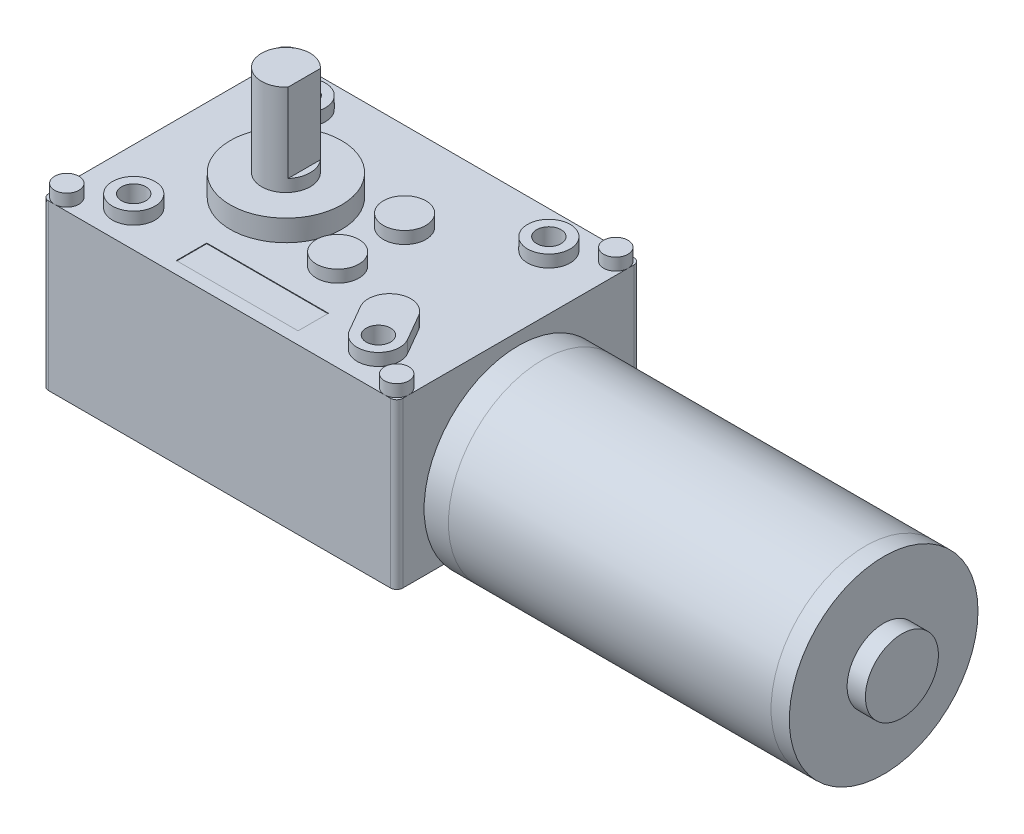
from build123d import *

# Parameters (mm, degrees)
SKETCH1_W            = 58.2
SKETCH1_H            = 40
BOSS_EXTRUDE1_DEPTH  = 13.5
SKETCH2_R            = 2
BOSS_EXTRUDE2_DEPTH  = 2
SKETCH3_R            = 3.5
BOSS_EXTRUDE3_DEPTH  = 15.5
SKETCH4_R            = 9.15
BOSS_EXTRUDE4_DEPTH  = 17
SKETCH5_R            = 4
BOSS_EXTRUDE5_DEPTH  = 2
BOSS_EXTRUDE6_DEPTH  = 13
SKETCH7_R            = 15.5
BOSS_EXTRUDE7_DEPTH  = 4
SKETCH8_R            = 15.5
BOSS_EXTRUDE8_DEPTH  = 53
SKETCH9_R            = 15.5
BOSS_EXTRUDE9_DEPTH  = 3
SKETCH11_R           = 6
BOSS_EXTRUDE10_DEPTH = 3
FILLET1_R            = 1
SKETCH12_R           = 2
CUT_EXTRUDE1_DEPTH   = 3
CUT_EXTRUDE2_START   = -3
SKETCH13_R           = 2
CUT_EXTRUDE2_DEPTH   = 3
SKETCH14_W           = 20
SKETCH14_H           = 5
CUT_EXTRUDE3_DEPTH   = 0.1
SKETCH15_W           = 20
SKETCH15_H           = 5
CUT_EXTRUDE4_DEPTH   = 0.1


with BuildPart() as part:
    # Sketch1 → Boss-Extrude1 (new, symmetric)
    with BuildSketch(Plane(origin=(0, 0, 0), x_dir=(1, 0, 0), z_dir=(0, 1, 0))):
        with Locations((29.1, 20)):
            Rectangle(SKETCH1_W, SKETCH1_H)
    extrude(amount=BOSS_EXTRUDE1_DEPTH, both=True)

    # Sketch2 → Boss-Extrude2 (add)
    with BuildSketch(Plane(origin=(0, 13.5, 0), x_dir=(1, 0, 0), z_dir=(0, 1, 0))):
        with Locations(Location((2, 38, 0), (0, 0, 90))):
            Circle(SKETCH2_R)
        with Locations(Location((56.2, 38, 0), (0, 0, 90))):
            Circle(SKETCH2_R)
        with Locations(Location((56.2, 2, 0), (0, 0, 270))):
            Circle(SKETCH2_R)
        with Locations(Location((2, 2, 0), (0, 0, 270))):
            Circle(SKETCH2_R)
    extrude(amount=BOSS_EXTRUDE2_DEPTH)

    # Sketch3 → Boss-Extrude3 (add, symmetric)
    with BuildSketch(Plane(origin=(0, 0, 0), x_dir=(1, 0, 0), z_dir=(0, 1, 0))):
        with Locations(Location((9, 34, 0), (0, 0, 90))):
            Circle(SKETCH3_R)
        with Locations(Location((49.2, 34, 0), (0, 0, 90))):
            Circle(SKETCH3_R)
        with Locations(Location((9, 6, 0), (0, 0, 90))):
            Circle(SKETCH3_R)
        with Locations(Location((34, 14.5, 0), (0, 0, 90))):
            Circle(SKETCH3_R)
        with Locations(Location((34, 25.5, 0), (0, 0, 90))):
            Circle(SKETCH3_R)
        with BuildLine():
            Line((49.731088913, 12.080127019), (52.231088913, 7.75))
            ThreePointArc((52.231088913, 7.75), (50.95, 2.968911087), (46.168911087, 4.25))
            Line((46.168911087, 4.25), (43.668911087, 8.580127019))
            ThreePointArc((43.668911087, 8.580127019), (44.95, 13.361215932), (49.731088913, 12.080127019))
        make_face()
    extrude(amount=BOSS_EXTRUDE3_DEPTH, both=True)

    # Sketch4 → Boss-Extrude4 (add, symmetric)
    with BuildSketch(Plane(origin=(0, 0, 0), x_dir=(1, 0, 0), z_dir=(0, 1, 0))):
        with Locations(Location((20, 20, 0), (0, 0, 90))):
            Circle(SKETCH4_R)
    extrude(amount=BOSS_EXTRUDE4_DEPTH, both=True)

    # Sketch5 → Boss-Extrude5 (add)
    with BuildSketch(Plane(origin=(0, 17, 0), x_dir=(1, 0, 0), z_dir=(0, 1, 0))):
        with Locations(Location((20, 20, 0), (0, 0, 270))):
            Circle(SKETCH5_R)
    extrude(amount=BOSS_EXTRUDE5_DEPTH)

    # Sketch6 → Boss-Extrude6 (add)
    with BuildSketch(Plane(origin=(0, 19, 0), x_dir=(1, 0, 0), z_dir=(0, 1, 0))):
        with BuildLine():
            Line((23, 17.354248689), (23, 22.645751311))
            ThreePointArc((23, 22.645751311), (16, 20), (23, 17.354248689))
        make_face()
    extrude(amount=BOSS_EXTRUDE6_DEPTH)

    # Fillet1
    fillet1_edges = [part.edges().sort_by_distance(p)[0] for p in [
        (0, 0, -40),
        (58.2, 0, -40),
        (58.2, 0, 0),
        (0, 0, 0),
    ]]
    fillet(fillet1_edges, radius=FILLET1_R)

    # Sketch12 → Cut-Extrude1 (cut)
    with BuildSketch(Plane(origin=(0, 15.5, 0), x_dir=(1, 0, 0), z_dir=(0, 1, 0))):
        with Locations(Location((9, 6, 0), (0, 0, 270))):
            Circle(SKETCH12_R)
        with Locations(Location((9, 34, 0), (0, 0, 270))):
            Circle(SKETCH12_R)
        with Locations(Location((49.2, 34, 0), (0, 0, 270))):
            Circle(SKETCH12_R)
        with Locations(Location((49.2, 6, 0), (0, 0, 270))):
            Circle(SKETCH12_R)
    extrude(amount=-CUT_EXTRUDE1_DEPTH, mode=Mode.SUBTRACT)

    # Sketch13 → Cut-Extrude2 (cut)
    with BuildSketch(Plane.XZ.offset(15.5).offset(CUT_EXTRUDE2_START)):
        with Locations(Location((9, -6, 0), (0, 0, 90))):
            Circle(SKETCH13_R)
        with Locations(Location((9, -34, 0), (0, 0, 90))):
            Circle(SKETCH13_R)
        with Locations(Location((49.2, -6, 0), (0, 0, 90))):
            Circle(SKETCH13_R)
        with Locations(Location((49.2, -34, 0), (0, 0, 90))):
            Circle(SKETCH13_R)
    extrude(amount=CUT_EXTRUDE2_DEPTH, mode=Mode.SUBTRACT)

    # Sketch14 → Cut-Extrude3 (cut)
    with BuildSketch(Plane(origin=(0, 13.5, 0), x_dir=(1, 0, 0), z_dir=(0, 1, 0))):
        with Locations((30, 4.5)):
            Rectangle(SKETCH14_W, SKETCH14_H)
    extrude(amount=-CUT_EXTRUDE3_DEPTH, mode=Mode.SUBTRACT)

    # Sketch15 → Cut-Extrude4 (cut)
    with BuildSketch(Plane.XZ.offset(13.5)):
        with Locations((30, -4.5)):
            Rectangle(SKETCH15_W, SKETCH15_H)
    extrude(amount=-CUT_EXTRUDE4_DEPTH, mode=Mode.SUBTRACT)


with BuildPart() as body_2:
    # Sketch7 → Boss-Extrude7 (new body)
    with BuildSketch(Plane(origin=(58.2, 0, 0), x_dir=(0, 0, -1), z_dir=(1, 0, 0))):
        with Locations((20, -4)):
            Circle(SKETCH7_R)
    extrude(amount=BOSS_EXTRUDE7_DEPTH)


with BuildPart() as body_3:
    # Sketch8 → Boss-Extrude8 (new body)
    with BuildSketch(Plane(origin=(62.2, 0, 0), x_dir=(0, 0, -1), z_dir=(1, 0, 0))):
        with Locations((20, -4)):
            Circle(SKETCH8_R)
    extrude(amount=BOSS_EXTRUDE8_DEPTH)


with BuildPart() as body_4:
    # Sketch9 → Boss-Extrude9 (new body)
    with BuildSketch(Plane(origin=(115.2, 0, 0), x_dir=(0, 0, -1), z_dir=(1, 0, 0))):
        with Locations((20, -4)):
            Circle(SKETCH9_R)
    extrude(amount=BOSS_EXTRUDE9_DEPTH)

    # Sketch11 → Boss-Extrude10 (add)
    with BuildSketch(Plane(origin=(118.2, 0, 0), x_dir=(0, 0, -1), z_dir=(1, 0, 0))):
        with Locations((20, -4)):
            Circle(SKETCH11_R)
    extrude(amount=BOSS_EXTRUDE10_DEPTH)


solid = Compound([part.part, body_2.part, body_3.part, body_4.part])
